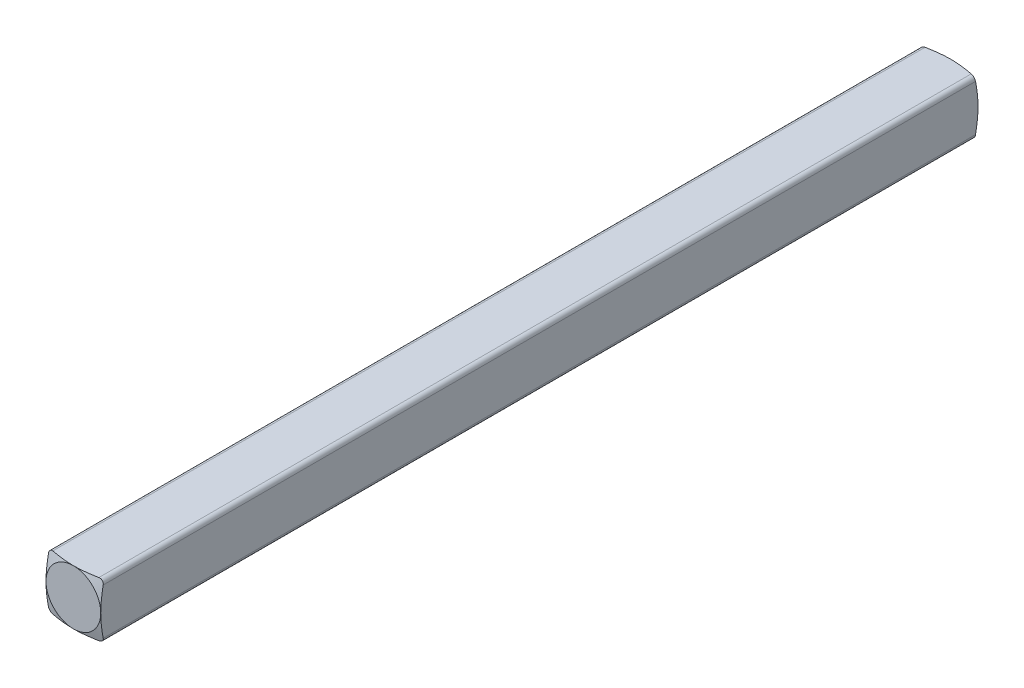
ISO-10303-21;
HEADER;
FILE_DESCRIPTION(('STEP AP214'),'2;1');
FILE_NAME('part.step','',(''),(''),'','','');
FILE_SCHEMA(('AUTOMOTIVE_DESIGN { 1 0 10303 214 1 1 1 1 }'));
ENDSEC;
DATA;
#1=APPLICATION_CONTEXT('core data for automotive mechanical design processes');
#2=APPLICATION_PROTOCOL_DEFINITION('international standard','automotive_design',2000,#1);
#3=PRODUCT_CONTEXT('',#1,'mechanical');
#4=PRODUCT('Part','Part','',(#3));
#5=PRODUCT_RELATED_PRODUCT_CATEGORY('part','',(#4));
#6=PRODUCT_DEFINITION_FORMATION('','',#4);
#7=PRODUCT_DEFINITION_CONTEXT('part definition',#1,'design');
#8=PRODUCT_DEFINITION('design','',#6,#7);
#9=PRODUCT_DEFINITION_SHAPE('','',#8);
#10=(LENGTH_UNIT() NAMED_UNIT(*) SI_UNIT(.MILLI.,.METRE.));
#11=(NAMED_UNIT(*) PLANE_ANGLE_UNIT() SI_UNIT($,.RADIAN.));
#12=(NAMED_UNIT(*) SI_UNIT($,.STERADIAN.) SOLID_ANGLE_UNIT());
#13=UNCERTAINTY_MEASURE_WITH_UNIT(LENGTH_MEASURE(1.E-05),#10,'distance_accuracy_value','');
#14=(GEOMETRIC_REPRESENTATION_CONTEXT(3) GLOBAL_UNCERTAINTY_ASSIGNED_CONTEXT((#13)) GLOBAL_UNIT_ASSIGNED_CONTEXT((#10,
#11,#12)) REPRESENTATION_CONTEXT('',''));
#15=CARTESIAN_POINT('',(0.,0.,0.));
#16=DIRECTION('',(0.,0.,1.));
#17=DIRECTION('',(1.,0.,0.));
#18=AXIS2_PLACEMENT_3D('',#15,#16,#17);
#19=CARTESIAN_POINT('',(-1.53487723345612,-1.585,25.4));
#20=DIRECTION('',(1.,0.,0.));
#21=DIRECTION('',(0.,1.,0.));
#22=AXIS2_PLACEMENT_3D('',#19,#20,#21);
#23=PLANE('',#22);
#24=CARTESIAN_POINT('',(-1.53487723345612,-3.1666652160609,-24.8259021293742));
#25=CARTESIAN_POINT('',(-1.53487723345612,-3.08469064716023,-24.8474134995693));
#26=CARTESIAN_POINT('',(-1.53487723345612,-3.0026760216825,-24.8687725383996));
#27=CARTESIAN_POINT('',(-1.53487723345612,-2.83854664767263,-24.9111088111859));
#28=CARTESIAN_POINT('',(-1.53487723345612,-2.75643189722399,-24.9320860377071));
#29=CARTESIAN_POINT('',(-1.53487723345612,-2.50995900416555,-24.9943162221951));
#30=CARTESIAN_POINT('',(-1.53487723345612,-2.34542557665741,-25.03488001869));
#31=CARTESIAN_POINT('',(-1.53487723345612,-2.01672815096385,-25.1129127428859));
#32=CARTESIAN_POINT('',(-1.53487723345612,-1.85256851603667,-25.150399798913));
#33=CARTESIAN_POINT('',(-1.53487723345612,-1.52315459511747,-25.2208840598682));
#34=CARTESIAN_POINT('',(-1.53487723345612,-1.3578996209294,-25.2538780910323));
#35=CARTESIAN_POINT('',(-1.53487723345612,-1.02346692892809,-25.3128592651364));
#36=CARTESIAN_POINT('',(-1.53487723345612,-0.854267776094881,-25.3387322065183));
#37=CARTESIAN_POINT('',(-1.53487723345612,-0.599515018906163,-25.368359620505));
#38=CARTESIAN_POINT('',(-1.53487723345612,-0.514501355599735,-25.3767023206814));
#39=CARTESIAN_POINT('',(-1.53487723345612,-0.34419324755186,-25.3897696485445));
#40=CARTESIAN_POINT('',(-1.53487723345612,-0.258898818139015,-25.3944944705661));
#41=CARTESIAN_POINT('',(-1.53487723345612,-0.0877661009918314,-25.3999590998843));
#42=CARTESIAN_POINT('',(-1.53487723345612,-0.0019271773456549,-25.4006795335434));
#43=CARTESIAN_POINT('',(-1.53487723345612,0.169686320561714,-25.39801863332));
#44=CARTESIAN_POINT('',(-1.53487723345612,0.25546089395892,-25.3946372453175));
#45=CARTESIAN_POINT('',(-1.53487723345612,0.426896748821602,-25.3840536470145));
#46=CARTESIAN_POINT('',(-1.53487723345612,0.51255766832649,-25.3768457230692));
#47=CARTESIAN_POINT('',(-1.53487723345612,0.683531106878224,-25.3591333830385));
#48=CARTESIAN_POINT('',(-1.53487723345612,0.768843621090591,-25.3486289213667));
#49=CARTESIAN_POINT('',(-1.53487723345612,0.97405504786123,-25.3200668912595));
#50=CARTESIAN_POINT('',(-1.53487723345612,1.09376665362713,-25.3006791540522));
#51=CARTESIAN_POINT('',(-1.53487723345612,1.33251777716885,-25.2580930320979));
#52=CARTESIAN_POINT('',(-1.53487723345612,1.45155714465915,-25.2348938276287));
#53=CARTESIAN_POINT('',(-1.53487723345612,1.68916216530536,-25.1858147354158));
#54=CARTESIAN_POINT('',(-1.53487723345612,1.80772743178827,-25.159932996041));
#55=CARTESIAN_POINT('',(-1.53487723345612,2.04441891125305,-25.1062944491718));
#56=CARTESIAN_POINT('',(-1.53487723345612,2.1625451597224,-25.0785377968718));
#57=CARTESIAN_POINT('',(-1.53487723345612,2.39875520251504,-25.021613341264));
#58=CARTESIAN_POINT('',(-1.53487723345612,2.5168382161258,-24.9924423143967));
#59=CARTESIAN_POINT('',(-1.53487723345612,2.75275603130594,-24.9331112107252));
#60=CARTESIAN_POINT('',(-1.53487723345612,2.8705908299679,-24.9029511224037));
#61=CARTESIAN_POINT('',(-1.53487723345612,3.22371274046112,-24.8114063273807));
#62=CARTESIAN_POINT('',(-1.53487723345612,3.45871696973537,-24.7489325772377));
#63=CARTESIAN_POINT('',(-1.53487723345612,3.92636425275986,-24.6228008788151));
#64=CARTESIAN_POINT('',(-1.53487723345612,4.15901102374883,-24.5591566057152));
#65=CARTESIAN_POINT('',(-1.53487723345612,4.62403801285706,-24.4307856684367));
#66=CARTESIAN_POINT('',(-1.53487723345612,4.85641819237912,-24.3660588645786));
#67=CARTESIAN_POINT('',(-1.53487723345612,5.31976447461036,-24.2362295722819));
#68=CARTESIAN_POINT('',(-1.53487723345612,5.55073162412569,-24.1711308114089));
#69=CARTESIAN_POINT('',(-1.53487723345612,6.01248807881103,-24.0404294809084));
#70=CARTESIAN_POINT('',(-1.53487723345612,6.24327740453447,-23.9748269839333));
#71=CARTESIAN_POINT('',(-1.53487723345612,6.47402102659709,-23.9090655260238));
#72=B_SPLINE_CURVE_WITH_KNOTS('',3,(#24,#25,#26,#27,#28,#29,#30,#31,#32,#33,#34,#35,#36,#37,#38,
#39,#40,#41,#42,#43,#44,#45,#46,#47,#48,#49,#50,#51,#52,#53,#54,#55,#56,#57,#58,#59,#60,#61,#62,
#63,#64,#65,#66,#67,#68,#69,#70,#71),.UNSPECIFIED.,.F.,.F.,(4,2,2,2,2,2,2,2,2,2,2,2,2,2,2,2,2,2,
2,2,2,2,2,4),(0.,0.254249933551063,0.508504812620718,1.01686983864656,1.5219847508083,
2.02745463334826,2.54061232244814,2.79681427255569,3.05300245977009,3.31042903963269,
3.56785901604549,3.82567446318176,4.08349347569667,4.44721252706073,4.81100990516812,
5.17506008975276,5.539080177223,5.90397296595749,6.2688700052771,6.99835638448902,
7.72193914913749,8.44561600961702,9.16551335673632,9.88530875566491),.UNSPECIFIED.);
#73=CARTESIAN_POINT('',(-1.53487723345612,0.,-25.4));
#74=VERTEX_POINT('',#73);
#75=CARTESIAN_POINT('',(-1.53487723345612,-1.335,-25.25698643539));
#76=VERTEX_POINT('',#75);
#77=EDGE_CURVE('E126',#74,#76,#72,.F.);
#78=ORIENTED_EDGE('',*,*,#77,.T.);
#79=DIRECTION('',(0.,0.,-1.));
#80=VECTOR('',#79,1.);
#81=CARTESIAN_POINT('',(-1.53487723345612,-1.335,25.4));
#82=LINE('',#81,#80);
#83=CARTESIAN_POINT('',(-1.53487723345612,-1.335,25.25698643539));
#84=VERTEX_POINT('',#83);
#85=EDGE_CURVE('E56',#76,#84,#82,.F.);
#86=ORIENTED_EDGE('',*,*,#85,.T.);
#87=CARTESIAN_POINT('',(-1.53487723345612,-3.1666652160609,24.8259021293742));
#88=CARTESIAN_POINT('',(-1.53487723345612,-3.08469064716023,24.8474134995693));
#89=CARTESIAN_POINT('',(-1.53487723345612,-3.0026760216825,24.8687725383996));
#90=CARTESIAN_POINT('',(-1.53487723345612,-2.83854664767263,24.9111088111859));
#91=CARTESIAN_POINT('',(-1.53487723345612,-2.75643189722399,24.9320860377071));
#92=CARTESIAN_POINT('',(-1.53487723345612,-2.50995900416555,24.9943162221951));
#93=CARTESIAN_POINT('',(-1.53487723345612,-2.34542557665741,25.03488001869));
#94=CARTESIAN_POINT('',(-1.53487723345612,-2.01672815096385,25.1129127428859));
#95=CARTESIAN_POINT('',(-1.53487723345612,-1.85256851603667,25.150399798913));
#96=CARTESIAN_POINT('',(-1.53487723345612,-1.52315459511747,25.2208840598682));
#97=CARTESIAN_POINT('',(-1.53487723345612,-1.3578996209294,25.2538780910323));
#98=CARTESIAN_POINT('',(-1.53487723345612,-1.02346692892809,25.3128592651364));
#99=CARTESIAN_POINT('',(-1.53487723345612,-0.854267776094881,25.3387322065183));
#100=CARTESIAN_POINT('',(-1.53487723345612,-0.599515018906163,25.368359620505));
#101=CARTESIAN_POINT('',(-1.53487723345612,-0.514501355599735,25.3767023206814));
#102=CARTESIAN_POINT('',(-1.53487723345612,-0.34419324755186,25.3897696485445));
#103=CARTESIAN_POINT('',(-1.53487723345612,-0.258898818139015,25.3944944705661));
#104=CARTESIAN_POINT('',(-1.53487723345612,-0.0877661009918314,25.3999590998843));
#105=CARTESIAN_POINT('',(-1.53487723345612,-0.0019271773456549,25.4006795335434));
#106=CARTESIAN_POINT('',(-1.53487723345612,0.169686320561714,25.39801863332));
#107=CARTESIAN_POINT('',(-1.53487723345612,0.25546089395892,25.3946372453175));
#108=CARTESIAN_POINT('',(-1.53487723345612,0.426896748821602,25.3840536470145));
#109=CARTESIAN_POINT('',(-1.53487723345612,0.51255766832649,25.3768457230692));
#110=CARTESIAN_POINT('',(-1.53487723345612,0.683531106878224,25.3591333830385));
#111=CARTESIAN_POINT('',(-1.53487723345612,0.768843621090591,25.3486289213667));
#112=CARTESIAN_POINT('',(-1.53487723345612,0.97405504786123,25.3200668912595));
#113=CARTESIAN_POINT('',(-1.53487723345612,1.09376665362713,25.3006791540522));
#114=CARTESIAN_POINT('',(-1.53487723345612,1.33251777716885,25.2580930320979));
#115=CARTESIAN_POINT('',(-1.53487723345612,1.45155714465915,25.2348938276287));
#116=CARTESIAN_POINT('',(-1.53487723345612,1.68916216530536,25.1858147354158));
#117=CARTESIAN_POINT('',(-1.53487723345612,1.80772743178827,25.159932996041));
#118=CARTESIAN_POINT('',(-1.53487723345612,2.04441891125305,25.1062944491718));
#119=CARTESIAN_POINT('',(-1.53487723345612,2.1625451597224,25.0785377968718));
#120=CARTESIAN_POINT('',(-1.53487723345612,2.39875520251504,25.021613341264));
#121=CARTESIAN_POINT('',(-1.53487723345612,2.5168382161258,24.9924423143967));
#122=CARTESIAN_POINT('',(-1.53487723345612,2.75275603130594,24.9331112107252));
#123=CARTESIAN_POINT('',(-1.53487723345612,2.8705908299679,24.9029511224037));
#124=CARTESIAN_POINT('',(-1.53487723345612,3.22371274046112,24.8114063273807));
#125=CARTESIAN_POINT('',(-1.53487723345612,3.45871696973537,24.7489325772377));
#126=CARTESIAN_POINT('',(-1.53487723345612,3.92636425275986,24.6228008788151));
#127=CARTESIAN_POINT('',(-1.53487723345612,4.15901102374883,24.5591566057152));
#128=CARTESIAN_POINT('',(-1.53487723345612,4.62403801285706,24.4307856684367));
#129=CARTESIAN_POINT('',(-1.53487723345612,4.85641819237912,24.3660588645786));
#130=CARTESIAN_POINT('',(-1.53487723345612,5.31976447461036,24.2362295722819));
#131=CARTESIAN_POINT('',(-1.53487723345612,5.55073162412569,24.1711308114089));
#132=CARTESIAN_POINT('',(-1.53487723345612,6.01248807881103,24.0404294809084));
#133=CARTESIAN_POINT('',(-1.53487723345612,6.24327740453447,23.9748269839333));
#134=CARTESIAN_POINT('',(-1.53487723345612,6.47402102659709,23.9090655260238));
#135=B_SPLINE_CURVE_WITH_KNOTS('',3,(#87,#88,#89,#90,#91,#92,#93,#94,#95,#96,#97,#98,#99,#100,
#101,#102,#103,#104,#105,#106,#107,#108,#109,#110,#111,#112,#113,#114,#115,#116,#117,#118,#119,
#120,#121,#122,#123,#124,#125,#126,#127,#128,#129,#130,#131,#132,#133,#134),.UNSPECIFIED.,.F.,
.F.,(4,2,2,2,2,2,2,2,2,2,2,2,2,2,2,2,2,2,2,2,2,2,2,4),(0.,0.254249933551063,0.508504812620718,
1.01686983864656,1.5219847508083,2.02745463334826,2.54061232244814,2.79681427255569,
3.05300245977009,3.31042903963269,3.56785901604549,3.82567446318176,4.08349347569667,
4.44721252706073,4.81100990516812,5.17506008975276,5.539080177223,5.90397296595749,
6.2688700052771,6.99835638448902,7.72193914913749,8.44561600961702,9.16551335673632,
9.88530875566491),.UNSPECIFIED.);
#136=CARTESIAN_POINT('',(-1.53487723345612,0.,25.4));
#137=VERTEX_POINT('',#136);
#138=EDGE_CURVE('E453',#84,#137,#135,.T.);
#139=ORIENTED_EDGE('',*,*,#138,.T.);
#140=CARTESIAN_POINT('',(-1.53487723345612,1.33500000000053,25.2569864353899));
#141=VERTEX_POINT('',#140);
#142=EDGE_CURVE('E187',#137,#141,#135,.T.);
#143=ORIENTED_EDGE('',*,*,#142,.T.);
#144=DIRECTION('',(0.,0.,-1.));
#145=VECTOR('',#144,1.);
#146=CARTESIAN_POINT('',(-1.53487723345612,1.335,25.4));
#147=LINE('',#146,#145);
#148=CARTESIAN_POINT('',(-1.53487723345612,1.33500000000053,-25.2569864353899));
#149=VERTEX_POINT('',#148);
#150=EDGE_CURVE('E128',#141,#149,#147,.T.);
#151=ORIENTED_EDGE('',*,*,#150,.T.);
#152=EDGE_CURVE('E124',#149,#74,#72,.F.);
#153=ORIENTED_EDGE('',*,*,#152,.T.);
#154=EDGE_LOOP('',(#78,#86,#139,#143,#151,#153));
#155=FACE_BOUND('',#154,.T.);
#156=ADVANCED_FACE('F30',(#155),#23,.F.);
#157=CARTESIAN_POINT('',(-1.53487723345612,-1.585,25.4));
#158=DIRECTION('',(0.,1.,0.));
#159=DIRECTION('',(-1.,0.,0.));
#160=AXIS2_PLACEMENT_3D('',#157,#158,#159);
#161=PLANE('',#160);
#162=CARTESIAN_POINT('',(-3.11654636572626,-1.585,-24.8259011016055));
#163=CARTESIAN_POINT('',(-3.03457163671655,-1.585,-24.8474125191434));
#164=CARTESIAN_POINT('',(-2.95255685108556,-1.585,-24.8687716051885));
#165=CARTESIAN_POINT('',(-2.78842715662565,-1.585,-24.9111079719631));
#166=CARTESIAN_POINT('',(-2.70631224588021,-1.585,-24.932085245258));
#167=CARTESIAN_POINT('',(-2.45983887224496,-1.585,-24.9943155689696));
#168=CARTESIAN_POINT('',(-2.29530512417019,-1.585,-25.0348794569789));
#169=CARTESIAN_POINT('',(-1.96660706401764,-1.585,-25.1129123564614));
#170=CARTESIAN_POINT('',(-1.80244711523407,-1.585,-25.1503994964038));
#171=CARTESIAN_POINT('',(-1.4730325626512,-1.585,-25.2208839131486));
#172=CARTESIAN_POINT('',(-1.30777727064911,-1.585,-25.2538780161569));
#173=CARTESIAN_POINT('',(-0.973343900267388,-1.585,-25.3128593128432));
#174=CARTESIAN_POINT('',(-0.804144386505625,-1.585,-25.3387323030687));
#175=CARTESIAN_POINT('',(-0.549391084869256,-1.585,-25.3683597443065));
#176=CARTESIAN_POINT('',(-0.464377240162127,-1.585,-25.3767024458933));
#177=CARTESIAN_POINT('',(-0.294068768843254,-1.585,-25.3897697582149));
#178=CARTESIAN_POINT('',(-0.208774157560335,-1.585,-25.3944945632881));
#179=CARTESIAN_POINT('',(-0.0376410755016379,-1.585,-25.3999591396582));
#180=CARTESIAN_POINT('',(0.0481980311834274,-1.585,-25.400679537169));
#181=CARTESIAN_POINT('',(0.219811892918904,-1.585,-25.3980185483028));
#182=CARTESIAN_POINT('',(0.305586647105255,-1.585,-25.3946371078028));
#183=CARTESIAN_POINT('',(0.477022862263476,-1.585,-25.384053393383));
#184=CARTESIAN_POINT('',(0.562683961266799,-1.585,-25.3768454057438));
#185=CARTESIAN_POINT('',(0.733657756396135,-1.585,-25.35913293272));
#186=CARTESIAN_POINT('',(0.818970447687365,-1.585,-25.3486284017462));
#187=CARTESIAN_POINT('',(1.02418204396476,-1.585,-25.3200662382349));
#188=CARTESIAN_POINT('',(1.14389364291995,-1.585,-25.3006784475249));
#189=CARTESIAN_POINT('',(1.38264475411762,-1.585,-25.2580922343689));
#190=CARTESIAN_POINT('',(1.50168411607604,-1.585,-25.2348929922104));
#191=CARTESIAN_POINT('',(1.73928912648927,-1.585,-25.1858138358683));
#192=CARTESIAN_POINT('',(1.85785438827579,-1.585,-25.1599320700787));
#193=CARTESIAN_POINT('',(2.09454585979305,-1.585,-25.1062934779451));
#194=CARTESIAN_POINT('',(2.21267210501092,-1.585,-25.0785368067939));
#195=CARTESIAN_POINT('',(2.44888213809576,-1.585,-25.0216123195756));
#196=CARTESIAN_POINT('',(2.56696514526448,-1.585,-24.9924412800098));
#197=CARTESIAN_POINT('',(2.80288294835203,-1.585,-24.9331101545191));
#198=CARTESIAN_POINT('',(2.92071774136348,-1.585,-24.902950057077));
#199=CARTESIAN_POINT('',(3.27383963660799,-1.585,-24.8114052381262));
#200=CARTESIAN_POINT('',(3.50884385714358,-1.585,-24.7489314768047));
#201=CARTESIAN_POINT('',(3.97649110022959,-1.585,-24.6227997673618));
#202=CARTESIAN_POINT('',(4.20913784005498,-1.585,-24.5591554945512));
#203=CARTESIAN_POINT('',(4.67416476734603,-1.585,-24.4307845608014));
#204=CARTESIAN_POINT('',(4.90654491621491,-1.585,-24.3660577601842));
#205=CARTESIAN_POINT('',(5.36989115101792,-1.585,-24.2362284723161));
#206=CARTESIAN_POINT('',(5.60085828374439,-1.585,-24.1711297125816));
#207=CARTESIAN_POINT('',(6.06261470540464,-1.585,-24.0404283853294));
#208=CARTESIAN_POINT('',(6.29340401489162,-1.585,-23.9748258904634));
#209=CARTESIAN_POINT('',(6.52414762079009,-1.585,-23.9090644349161));
#210=B_SPLINE_CURVE_WITH_KNOTS('',3,(#162,#163,#164,#165,#166,#167,#168,#169,#170,#171,#172,
#173,#174,#175,#176,#177,#178,#179,#180,#181,#182,#183,#184,#185,#186,#187,#188,#189,#190,#191,
#192,#193,#194,#195,#196,#197,#198,#199,#200,#201,#202,#203,#204,#205,#206,#207,#208,#209),
.UNSPECIFIED.,.F.,.F.,(4,2,2,2,2,2,2,2,2,2,2,2,2,2,2,2,2,2,2,2,2,2,2,4),(0.,0.254250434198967,
0.508505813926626,1.01687183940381,1.52198772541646,2.02745858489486,2.54061736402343,
2.79681985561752,3.05300858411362,3.31043571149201,3.56786623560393,3.82568223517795,
4.08350180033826,4.44722085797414,4.81101824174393,5.17506842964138,5.53908852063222,
5.90398129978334,6.26887832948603,6.9983646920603,7.72194736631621,8.44562413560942,
9.16552143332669,9.88531678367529),.UNSPECIFIED.);
#211=CARTESIAN_POINT('',(0.0501227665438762,-1.585,-25.4));
#212=VERTEX_POINT('',#211);
#213=CARTESIAN_POINT('',(1.38512276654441,-1.585,-25.2569864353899));
#214=VERTEX_POINT('',#213);
#215=EDGE_CURVE('E208',#212,#214,#210,.T.);
#216=ORIENTED_EDGE('',*,*,#215,.T.);
#217=DIRECTION('',(0.,0.,-1.));
#218=VECTOR('',#217,1.);
#219=CARTESIAN_POINT('',(1.38512276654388,-1.585,25.4));
#220=LINE('',#219,#218);
#221=CARTESIAN_POINT('',(1.38512276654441,-1.585,25.2569864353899));
#222=VERTEX_POINT('',#221);
#223=EDGE_CURVE('E426',#214,#222,#220,.F.);
#224=ORIENTED_EDGE('',*,*,#223,.T.);
#225=CARTESIAN_POINT('',(-3.11654636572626,-1.585,24.8259011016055));
#226=CARTESIAN_POINT('',(-3.03457163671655,-1.585,24.8474125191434));
#227=CARTESIAN_POINT('',(-2.95255685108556,-1.585,24.8687716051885));
#228=CARTESIAN_POINT('',(-2.78842715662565,-1.585,24.9111079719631));
#229=CARTESIAN_POINT('',(-2.70631224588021,-1.585,24.932085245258));
#230=CARTESIAN_POINT('',(-2.45983887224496,-1.585,24.9943155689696));
#231=CARTESIAN_POINT('',(-2.29530512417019,-1.585,25.0348794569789));
#232=CARTESIAN_POINT('',(-1.96660706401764,-1.585,25.1129123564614));
#233=CARTESIAN_POINT('',(-1.80244711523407,-1.585,25.1503994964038));
#234=CARTESIAN_POINT('',(-1.4730325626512,-1.585,25.2208839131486));
#235=CARTESIAN_POINT('',(-1.30777727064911,-1.585,25.2538780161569));
#236=CARTESIAN_POINT('',(-0.973343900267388,-1.585,25.3128593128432));
#237=CARTESIAN_POINT('',(-0.804144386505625,-1.585,25.3387323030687));
#238=CARTESIAN_POINT('',(-0.549391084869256,-1.585,25.3683597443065));
#239=CARTESIAN_POINT('',(-0.464377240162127,-1.585,25.3767024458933));
#240=CARTESIAN_POINT('',(-0.294068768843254,-1.585,25.3897697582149));
#241=CARTESIAN_POINT('',(-0.208774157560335,-1.585,25.3944945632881));
#242=CARTESIAN_POINT('',(-0.0376410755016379,-1.585,25.3999591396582));
#243=CARTESIAN_POINT('',(0.0481980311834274,-1.585,25.400679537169));
#244=CARTESIAN_POINT('',(0.219811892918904,-1.585,25.3980185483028));
#245=CARTESIAN_POINT('',(0.305586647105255,-1.585,25.3946371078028));
#246=CARTESIAN_POINT('',(0.477022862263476,-1.585,25.384053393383));
#247=CARTESIAN_POINT('',(0.562683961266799,-1.585,25.3768454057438));
#248=CARTESIAN_POINT('',(0.733657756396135,-1.585,25.35913293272));
#249=CARTESIAN_POINT('',(0.818970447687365,-1.585,25.3486284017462));
#250=CARTESIAN_POINT('',(1.02418204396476,-1.585,25.3200662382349));
#251=CARTESIAN_POINT('',(1.14389364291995,-1.585,25.3006784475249));
#252=CARTESIAN_POINT('',(1.38264475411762,-1.585,25.2580922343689));
#253=CARTESIAN_POINT('',(1.50168411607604,-1.585,25.2348929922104));
#254=CARTESIAN_POINT('',(1.73928912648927,-1.585,25.1858138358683));
#255=CARTESIAN_POINT('',(1.85785438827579,-1.585,25.1599320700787));
#256=CARTESIAN_POINT('',(2.09454585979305,-1.585,25.1062934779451));
#257=CARTESIAN_POINT('',(2.21267210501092,-1.585,25.0785368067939));
#258=CARTESIAN_POINT('',(2.44888213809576,-1.585,25.0216123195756));
#259=CARTESIAN_POINT('',(2.56696514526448,-1.585,24.9924412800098));
#260=CARTESIAN_POINT('',(2.80288294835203,-1.585,24.9331101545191));
#261=CARTESIAN_POINT('',(2.92071774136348,-1.585,24.902950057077));
#262=CARTESIAN_POINT('',(3.27383963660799,-1.585,24.8114052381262));
#263=CARTESIAN_POINT('',(3.50884385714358,-1.585,24.7489314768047));
#264=CARTESIAN_POINT('',(3.97649110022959,-1.585,24.6227997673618));
#265=CARTESIAN_POINT('',(4.20913784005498,-1.585,24.5591554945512));
#266=CARTESIAN_POINT('',(4.67416476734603,-1.585,24.4307845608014));
#267=CARTESIAN_POINT('',(4.90654491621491,-1.585,24.3660577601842));
#268=CARTESIAN_POINT('',(5.36989115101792,-1.585,24.2362284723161));
#269=CARTESIAN_POINT('',(5.60085828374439,-1.585,24.1711297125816));
#270=CARTESIAN_POINT('',(6.06261470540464,-1.585,24.0404283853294));
#271=CARTESIAN_POINT('',(6.29340401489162,-1.585,23.9748258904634));
#272=CARTESIAN_POINT('',(6.52414762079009,-1.585,23.9090644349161));
#273=B_SPLINE_CURVE_WITH_KNOTS('',3,(#225,#226,#227,#228,#229,#230,#231,#232,#233,#234,#235,
#236,#237,#238,#239,#240,#241,#242,#243,#244,#245,#246,#247,#248,#249,#250,#251,#252,#253,#254,
#255,#256,#257,#258,#259,#260,#261,#262,#263,#264,#265,#266,#267,#268,#269,#270,#271,#272),
.UNSPECIFIED.,.F.,.F.,(4,2,2,2,2,2,2,2,2,2,2,2,2,2,2,2,2,2,2,2,2,2,2,4),(0.,0.254250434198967,
0.508505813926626,1.01687183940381,1.52198772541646,2.02745858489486,2.54061736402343,
2.79681985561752,3.05300858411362,3.31043571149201,3.56786623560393,3.82568223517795,
4.08350180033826,4.44722085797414,4.81101824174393,5.17506842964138,5.53908852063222,
5.90398129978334,6.26887832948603,6.9983646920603,7.72194736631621,8.44562413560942,
9.16552143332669,9.88531678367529),.UNSPECIFIED.);
#274=CARTESIAN_POINT('',(0.0501227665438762,-1.585,25.4));
#275=VERTEX_POINT('',#274);
#276=EDGE_CURVE('E174',#222,#275,#273,.F.);
#277=ORIENTED_EDGE('',*,*,#276,.T.);
#278=CARTESIAN_POINT('',(-1.28487723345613,-1.585,25.25698643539));
#279=VERTEX_POINT('',#278);
#280=EDGE_CURVE('E176',#275,#279,#273,.F.);
#281=ORIENTED_EDGE('',*,*,#280,.T.);
#282=DIRECTION('',(0.,0.,-1.));
#283=VECTOR('',#282,1.);
#284=CARTESIAN_POINT('',(-1.28487723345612,-1.585,25.4));
#285=LINE('',#284,#283);
#286=CARTESIAN_POINT('',(-1.28487723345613,-1.585,-25.25698643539));
#287=VERTEX_POINT('',#286);
#288=EDGE_CURVE('E431',#279,#287,#285,.T.);
#289=ORIENTED_EDGE('',*,*,#288,.T.);
#290=EDGE_CURVE('E141',#287,#212,#210,.T.);
#291=ORIENTED_EDGE('',*,*,#290,.T.);
#292=EDGE_LOOP('',(#216,#224,#277,#281,#289,#291));
#293=FACE_BOUND('',#292,.T.);
#294=ADVANCED_FACE('F197',(#293),#161,.F.);
#295=CARTESIAN_POINT('',(1.63512276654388,-1.585,25.4));
#296=DIRECTION('',(-1.,0.,0.));
#297=DIRECTION('',(0.,-1.,0.));
#298=AXIS2_PLACEMENT_3D('',#295,#296,#297);
#299=PLANE('',#298);
#300=CARTESIAN_POINT('',(1.63512276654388,-3.16666913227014,-24.8259011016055));
#301=CARTESIAN_POINT('',(1.63512276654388,-3.08469440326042,-24.8474125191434));
#302=CARTESIAN_POINT('',(1.63512276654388,-3.00267961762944,-24.8687716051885));
#303=CARTESIAN_POINT('',(1.63512276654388,-2.83854992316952,-24.9111079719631));
#304=CARTESIAN_POINT('',(1.63512276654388,-2.75643501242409,-24.932085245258));
#305=CARTESIAN_POINT('',(1.63512276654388,-2.50996163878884,-24.9943155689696));
#306=CARTESIAN_POINT('',(1.63512276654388,-2.34542789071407,-25.0348794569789));
#307=CARTESIAN_POINT('',(1.63512276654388,-2.01672983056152,-25.1129123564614));
#308=CARTESIAN_POINT('',(1.63512276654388,-1.85256988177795,-25.1503994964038));
#309=CARTESIAN_POINT('',(1.63512276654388,-1.52315532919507,-25.2208839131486));
#310=CARTESIAN_POINT('',(1.63512276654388,-1.35790003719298,-25.2538780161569));
#311=CARTESIAN_POINT('',(1.63512276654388,-1.02346666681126,-25.3128593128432));
#312=CARTESIAN_POINT('',(1.63512276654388,-0.854267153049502,-25.3387323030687));
#313=CARTESIAN_POINT('',(1.63512276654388,-0.599513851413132,-25.3683597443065));
#314=CARTESIAN_POINT('',(1.63512276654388,-0.514500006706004,-25.3767024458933));
#315=CARTESIAN_POINT('',(1.63512276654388,-0.34419153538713,-25.3897697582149));
#316=CARTESIAN_POINT('',(1.63512276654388,-0.258896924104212,-25.3944945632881));
#317=CARTESIAN_POINT('',(1.63512276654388,-0.0877638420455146,-25.3999591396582));
#318=CARTESIAN_POINT('',(1.63512276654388,-0.00192473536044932,-25.400679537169));
#319=CARTESIAN_POINT('',(1.63512276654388,0.169689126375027,-25.3980185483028));
#320=CARTESIAN_POINT('',(1.63512276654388,0.255463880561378,-25.3946371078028));
#321=CARTESIAN_POINT('',(1.63512276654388,0.4269000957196,-25.384053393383));
#322=CARTESIAN_POINT('',(1.63512276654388,0.512561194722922,-25.3768454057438));
#323=CARTESIAN_POINT('',(1.63512276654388,0.683534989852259,-25.35913293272));
#324=CARTESIAN_POINT('',(1.63512276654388,0.768847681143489,-25.3486284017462));
#325=CARTESIAN_POINT('',(1.63512276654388,0.974059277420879,-25.3200662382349));
#326=CARTESIAN_POINT('',(1.63512276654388,1.09377087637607,-25.3006784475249));
#327=CARTESIAN_POINT('',(1.63512276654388,1.33252198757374,-25.2580922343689));
#328=CARTESIAN_POINT('',(1.63512276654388,1.45156134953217,-25.2348929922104));
#329=CARTESIAN_POINT('',(1.63512276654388,1.6891663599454,-25.1858138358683));
#330=CARTESIAN_POINT('',(1.63512276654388,1.80773162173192,-25.1599320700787));
#331=CARTESIAN_POINT('',(1.63512276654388,2.04442309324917,-25.1062934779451));
#332=CARTESIAN_POINT('',(1.63512276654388,2.16254933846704,-25.0785368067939));
#333=CARTESIAN_POINT('',(1.63512276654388,2.39875937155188,-25.0216123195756));
#334=CARTESIAN_POINT('',(1.63512276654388,2.5168423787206,-24.9924412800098));
#335=CARTESIAN_POINT('',(1.63512276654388,2.75276018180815,-24.9331101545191));
#336=CARTESIAN_POINT('',(1.63512276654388,2.87059497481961,-24.902950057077));
#337=CARTESIAN_POINT('',(1.63512276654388,3.22371687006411,-24.8114052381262));
#338=CARTESIAN_POINT('',(1.63512276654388,3.4587210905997,-24.7489314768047));
#339=CARTESIAN_POINT('',(1.63512276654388,3.92636833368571,-24.6227997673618));
#340=CARTESIAN_POINT('',(1.63512276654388,4.1590150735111,-24.5591554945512));
#341=CARTESIAN_POINT('',(1.63512276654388,4.62404200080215,-24.4307845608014));
#342=CARTESIAN_POINT('',(1.63512276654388,4.85642214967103,-24.3660577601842));
#343=CARTESIAN_POINT('',(1.63512276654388,5.31976838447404,-24.2362284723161));
#344=CARTESIAN_POINT('',(1.63512276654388,5.55073551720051,-24.1711297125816));
#345=CARTESIAN_POINT('',(1.63512276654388,6.01249193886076,-24.0404283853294));
#346=CARTESIAN_POINT('',(1.63512276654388,6.24328124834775,-23.9748258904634));
#347=CARTESIAN_POINT('',(1.63512276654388,6.47402485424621,-23.9090644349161));
#348=B_SPLINE_CURVE_WITH_KNOTS('',3,(#300,#301,#302,#303,#304,#305,#306,#307,#308,#309,#310,
#311,#312,#313,#314,#315,#316,#317,#318,#319,#320,#321,#322,#323,#324,#325,#326,#327,#328,#329,
#330,#331,#332,#333,#334,#335,#336,#337,#338,#339,#340,#341,#342,#343,#344,#345,#346,#347),
.UNSPECIFIED.,.F.,.F.,(4,2,2,2,2,2,2,2,2,2,2,2,2,2,2,2,2,2,2,2,2,2,2,4),(0.,0.254250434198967,
0.508505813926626,1.01687183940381,1.52198772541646,2.02745858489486,2.54061736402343,
2.79681985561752,3.05300858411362,3.31043571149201,3.56786623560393,3.82568223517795,
4.08350180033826,4.44722085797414,4.81101824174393,5.17506842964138,5.53908852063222,
5.90398129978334,6.26887832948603,6.9983646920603,7.72194736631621,8.44562413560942,
9.16552143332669,9.88531678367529),.UNSPECIFIED.);
#349=CARTESIAN_POINT('',(1.63512276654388,0.,-25.4));
#350=VERTEX_POINT('',#349);
#351=CARTESIAN_POINT('',(1.63512276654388,1.33500000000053,-25.2569864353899));
#352=VERTEX_POINT('',#351);
#353=EDGE_CURVE('E215',#350,#352,#348,.T.);
#354=ORIENTED_EDGE('',*,*,#353,.T.);
#355=DIRECTION('',(0.,0.,-1.));
#356=VECTOR('',#355,1.);
#357=CARTESIAN_POINT('',(1.63512276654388,1.335,25.4));
#358=LINE('',#357,#356);
#359=CARTESIAN_POINT('',(1.63512276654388,1.33500000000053,25.2569864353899));
#360=VERTEX_POINT('',#359);
#361=EDGE_CURVE('E437',#352,#360,#358,.F.);
#362=ORIENTED_EDGE('',*,*,#361,.T.);
#363=CARTESIAN_POINT('',(1.63512276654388,-3.16666913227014,24.8259011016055));
#364=CARTESIAN_POINT('',(1.63512276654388,-3.08469440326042,24.8474125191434));
#365=CARTESIAN_POINT('',(1.63512276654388,-3.00267961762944,24.8687716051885));
#366=CARTESIAN_POINT('',(1.63512276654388,-2.83854992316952,24.9111079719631));
#367=CARTESIAN_POINT('',(1.63512276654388,-2.75643501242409,24.932085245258));
#368=CARTESIAN_POINT('',(1.63512276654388,-2.50996163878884,24.9943155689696));
#369=CARTESIAN_POINT('',(1.63512276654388,-2.34542789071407,25.0348794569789));
#370=CARTESIAN_POINT('',(1.63512276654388,-2.01672983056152,25.1129123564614));
#371=CARTESIAN_POINT('',(1.63512276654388,-1.85256988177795,25.1503994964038));
#372=CARTESIAN_POINT('',(1.63512276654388,-1.52315532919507,25.2208839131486));
#373=CARTESIAN_POINT('',(1.63512276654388,-1.35790003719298,25.2538780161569));
#374=CARTESIAN_POINT('',(1.63512276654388,-1.02346666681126,25.3128593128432));
#375=CARTESIAN_POINT('',(1.63512276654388,-0.854267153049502,25.3387323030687));
#376=CARTESIAN_POINT('',(1.63512276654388,-0.599513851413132,25.3683597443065));
#377=CARTESIAN_POINT('',(1.63512276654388,-0.514500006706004,25.3767024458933));
#378=CARTESIAN_POINT('',(1.63512276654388,-0.34419153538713,25.3897697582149));
#379=CARTESIAN_POINT('',(1.63512276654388,-0.258896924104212,25.3944945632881));
#380=CARTESIAN_POINT('',(1.63512276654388,-0.0877638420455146,25.3999591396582));
#381=CARTESIAN_POINT('',(1.63512276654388,-0.00192473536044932,25.400679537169));
#382=CARTESIAN_POINT('',(1.63512276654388,0.169689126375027,25.3980185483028));
#383=CARTESIAN_POINT('',(1.63512276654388,0.255463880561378,25.3946371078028));
#384=CARTESIAN_POINT('',(1.63512276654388,0.4269000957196,25.384053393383));
#385=CARTESIAN_POINT('',(1.63512276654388,0.512561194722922,25.3768454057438));
#386=CARTESIAN_POINT('',(1.63512276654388,0.683534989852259,25.35913293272));
#387=CARTESIAN_POINT('',(1.63512276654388,0.768847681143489,25.3486284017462));
#388=CARTESIAN_POINT('',(1.63512276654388,0.974059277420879,25.3200662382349));
#389=CARTESIAN_POINT('',(1.63512276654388,1.09377087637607,25.3006784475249));
#390=CARTESIAN_POINT('',(1.63512276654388,1.33252198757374,25.2580922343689));
#391=CARTESIAN_POINT('',(1.63512276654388,1.45156134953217,25.2348929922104));
#392=CARTESIAN_POINT('',(1.63512276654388,1.6891663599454,25.1858138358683));
#393=CARTESIAN_POINT('',(1.63512276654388,1.80773162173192,25.1599320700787));
#394=CARTESIAN_POINT('',(1.63512276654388,2.04442309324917,25.1062934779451));
#395=CARTESIAN_POINT('',(1.63512276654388,2.16254933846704,25.0785368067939));
#396=CARTESIAN_POINT('',(1.63512276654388,2.39875937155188,25.0216123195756));
#397=CARTESIAN_POINT('',(1.63512276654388,2.5168423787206,24.9924412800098));
#398=CARTESIAN_POINT('',(1.63512276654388,2.75276018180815,24.9331101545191));
#399=CARTESIAN_POINT('',(1.63512276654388,2.87059497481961,24.902950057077));
#400=CARTESIAN_POINT('',(1.63512276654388,3.22371687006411,24.8114052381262));
#401=CARTESIAN_POINT('',(1.63512276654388,3.4587210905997,24.7489314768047));
#402=CARTESIAN_POINT('',(1.63512276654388,3.92636833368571,24.6227997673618));
#403=CARTESIAN_POINT('',(1.63512276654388,4.1590150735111,24.5591554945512));
#404=CARTESIAN_POINT('',(1.63512276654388,4.62404200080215,24.4307845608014));
#405=CARTESIAN_POINT('',(1.63512276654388,4.85642214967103,24.3660577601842));
#406=CARTESIAN_POINT('',(1.63512276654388,5.31976838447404,24.2362284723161));
#407=CARTESIAN_POINT('',(1.63512276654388,5.55073551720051,24.1711297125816));
#408=CARTESIAN_POINT('',(1.63512276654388,6.01249193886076,24.0404283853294));
#409=CARTESIAN_POINT('',(1.63512276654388,6.24328124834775,23.9748258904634));
#410=CARTESIAN_POINT('',(1.63512276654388,6.47402485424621,23.9090644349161));
#411=B_SPLINE_CURVE_WITH_KNOTS('',3,(#363,#364,#365,#366,#367,#368,#369,#370,#371,#372,#373,
#374,#375,#376,#377,#378,#379,#380,#381,#382,#383,#384,#385,#386,#387,#388,#389,#390,#391,#392,
#393,#394,#395,#396,#397,#398,#399,#400,#401,#402,#403,#404,#405,#406,#407,#408,#409,#410),
.UNSPECIFIED.,.F.,.F.,(4,2,2,2,2,2,2,2,2,2,2,2,2,2,2,2,2,2,2,2,2,2,2,4),(0.,0.254250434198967,
0.508505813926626,1.01687183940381,1.52198772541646,2.02745858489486,2.54061736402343,
2.79681985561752,3.05300858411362,3.31043571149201,3.56786623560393,3.82568223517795,
4.08350180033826,4.44722085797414,4.81101824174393,5.17506842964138,5.53908852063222,
5.90398129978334,6.26887832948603,6.9983646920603,7.72194736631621,8.44562413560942,
9.16552143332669,9.88531678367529),.UNSPECIFIED.);
#412=CARTESIAN_POINT('',(1.63512276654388,0.,25.4));
#413=VERTEX_POINT('',#412);
#414=EDGE_CURVE('E451',#360,#413,#411,.F.);
#415=ORIENTED_EDGE('',*,*,#414,.T.);
#416=CARTESIAN_POINT('',(1.63512276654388,-1.335,25.25698643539));
#417=VERTEX_POINT('',#416);
#418=EDGE_CURVE('E181',#413,#417,#411,.F.);
#419=ORIENTED_EDGE('',*,*,#418,.T.);
#420=DIRECTION('',(0.,0.,-1.));
#421=VECTOR('',#420,1.);
#422=CARTESIAN_POINT('',(1.63512276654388,-1.335,25.4));
#423=LINE('',#422,#421);
#424=CARTESIAN_POINT('',(1.63512276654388,-1.335,-25.25698643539));
#425=VERTEX_POINT('',#424);
#426=EDGE_CURVE('E428',#417,#425,#423,.T.);
#427=ORIENTED_EDGE('',*,*,#426,.T.);
#428=EDGE_CURVE('E214',#425,#350,#348,.T.);
#429=ORIENTED_EDGE('',*,*,#428,.T.);
#430=EDGE_LOOP('',(#354,#362,#415,#419,#427,#429));
#431=FACE_BOUND('',#430,.T.);
#432=ADVANCED_FACE('F201',(#431),#299,.F.);
#433=CARTESIAN_POINT('',(-1.53487723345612,1.585,25.4));
#434=DIRECTION('',(0.,-1.,0.));
#435=DIRECTION('',(1.,0.,0.));
#436=AXIS2_PLACEMENT_3D('',#433,#434,#435);
#437=PLANE('',#436);
#438=CARTESIAN_POINT('',(-3.11654244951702,1.585,24.8259021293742));
#439=CARTESIAN_POINT('',(-3.03456788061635,1.585,24.8474134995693));
#440=CARTESIAN_POINT('',(-2.95255325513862,1.585,24.8687725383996));
#441=CARTESIAN_POINT('',(-2.78842388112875,1.585,24.9111088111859));
#442=CARTESIAN_POINT('',(-2.70630913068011,1.585,24.9320860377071));
#443=CARTESIAN_POINT('',(-2.45983623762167,1.585,24.9943162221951));
#444=CARTESIAN_POINT('',(-2.29530281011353,1.585,25.03488001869));
#445=CARTESIAN_POINT('',(-1.96660538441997,1.585,25.1129127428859));
#446=CARTESIAN_POINT('',(-1.80244574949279,1.585,25.150399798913));
#447=CARTESIAN_POINT('',(-1.47303182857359,1.585,25.2208840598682));
#448=CARTESIAN_POINT('',(-1.30777685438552,1.585,25.2538780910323));
#449=CARTESIAN_POINT('',(-0.973344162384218,1.585,25.3128592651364));
#450=CARTESIAN_POINT('',(-0.804145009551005,1.585,25.3387322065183));
#451=CARTESIAN_POINT('',(-0.549392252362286,1.585,25.368359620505));
#452=CARTESIAN_POINT('',(-0.464378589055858,1.585,25.3767023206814));
#453=CARTESIAN_POINT('',(-0.294070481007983,1.585,25.3897696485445));
#454=CARTESIAN_POINT('',(-0.208776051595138,1.585,25.3944944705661));
#455=CARTESIAN_POINT('',(-0.0376433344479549,1.585,25.3999590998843));
#456=CARTESIAN_POINT('',(0.0481955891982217,1.585,25.4006795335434));
#457=CARTESIAN_POINT('',(0.21980908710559,1.585,25.39801863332));
#458=CARTESIAN_POINT('',(0.305583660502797,1.585,25.3946372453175));
#459=CARTESIAN_POINT('',(0.477019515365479,1.585,25.3840536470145));
#460=CARTESIAN_POINT('',(0.562680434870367,1.585,25.3768457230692));
#461=CARTESIAN_POINT('',(0.733653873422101,1.585,25.3591333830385));
#462=CARTESIAN_POINT('',(0.818966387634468,1.585,25.3486289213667));
#463=CARTESIAN_POINT('',(1.02417781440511,1.585,25.3200668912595));
#464=CARTESIAN_POINT('',(1.143889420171,1.585,25.3006791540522));
#465=CARTESIAN_POINT('',(1.38264054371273,1.585,25.2580930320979));
#466=CARTESIAN_POINT('',(1.50167991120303,1.585,25.2348938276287));
#467=CARTESIAN_POINT('',(1.73928493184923,1.585,25.1858147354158));
#468=CARTESIAN_POINT('',(1.85785019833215,1.585,25.159932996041));
#469=CARTESIAN_POINT('',(2.09454167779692,1.585,25.1062944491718));
#470=CARTESIAN_POINT('',(2.21266792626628,1.585,25.0785377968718));
#471=CARTESIAN_POINT('',(2.44887796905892,1.585,25.021613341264));
#472=CARTESIAN_POINT('',(2.56696098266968,1.585,24.9924423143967));
#473=CARTESIAN_POINT('',(2.80287879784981,1.585,24.9331112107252));
#474=CARTESIAN_POINT('',(2.92071359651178,1.585,24.9029511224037));
#475=CARTESIAN_POINT('',(3.273835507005,1.585,24.8114063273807));
#476=CARTESIAN_POINT('',(3.50883973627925,1.585,24.7489325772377));
#477=CARTESIAN_POINT('',(3.97648701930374,1.585,24.6228008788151));
#478=CARTESIAN_POINT('',(4.20913379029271,1.585,24.5591566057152));
#479=CARTESIAN_POINT('',(4.67416077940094,1.585,24.4307856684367));
#480=CARTESIAN_POINT('',(4.906540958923,1.585,24.3660588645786));
#481=CARTESIAN_POINT('',(5.36988724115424,1.585,24.2362295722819));
#482=CARTESIAN_POINT('',(5.60085439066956,1.585,24.1711308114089));
#483=CARTESIAN_POINT('',(6.06261084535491,1.585,24.0404294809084));
#484=CARTESIAN_POINT('',(6.29340017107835,1.585,23.9748269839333));
#485=CARTESIAN_POINT('',(6.52414379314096,1.585,23.9090655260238));
#486=B_SPLINE_CURVE_WITH_KNOTS('',3,(#438,#439,#440,#441,#442,#443,#444,#445,#446,#447,#448,
#449,#450,#451,#452,#453,#454,#455,#456,#457,#458,#459,#460,#461,#462,#463,#464,#465,#466,#467,
#468,#469,#470,#471,#472,#473,#474,#475,#476,#477,#478,#479,#480,#481,#482,#483,#484,#485),
.UNSPECIFIED.,.F.,.F.,(4,2,2,2,2,2,2,2,2,2,2,2,2,2,2,2,2,2,2,2,2,2,2,4),(0.,0.254249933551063,
0.508504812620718,1.01686983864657,1.52198475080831,2.02745463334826,2.54061232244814,
2.79681427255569,3.05300245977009,3.31042903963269,3.56785901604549,3.82567446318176,
4.08349347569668,4.44721252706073,4.81100990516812,5.17506008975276,5.539080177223,
5.9039729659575,6.2688700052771,6.99835638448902,7.72193914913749,8.44561600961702,
9.16551335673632,9.88530875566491),.UNSPECIFIED.);
#487=CARTESIAN_POINT('',(0.0501227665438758,1.585,25.4));
#488=VERTEX_POINT('',#487);
#489=CARTESIAN_POINT('',(1.38512276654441,1.585,25.2569864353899));
#490=VERTEX_POINT('',#489);
#491=EDGE_CURVE('E449',#488,#490,#486,.T.);
#492=ORIENTED_EDGE('',*,*,#491,.T.);
#493=DIRECTION('',(0.,0.,-1.));
#494=VECTOR('',#493,1.);
#495=CARTESIAN_POINT('',(1.38512276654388,1.585,25.4));
#496=LINE('',#495,#494);
#497=CARTESIAN_POINT('',(1.38512276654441,1.585,-25.2569864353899));
#498=VERTEX_POINT('',#497);
#499=EDGE_CURVE('E157',#490,#498,#496,.T.);
#500=ORIENTED_EDGE('',*,*,#499,.T.);
#501=CARTESIAN_POINT('',(-3.11654244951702,1.585,-24.8259021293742));
#502=CARTESIAN_POINT('',(-3.03456788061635,1.585,-24.8474134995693));
#503=CARTESIAN_POINT('',(-2.95255325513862,1.585,-24.8687725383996));
#504=CARTESIAN_POINT('',(-2.78842388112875,1.585,-24.9111088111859));
#505=CARTESIAN_POINT('',(-2.70630913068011,1.585,-24.9320860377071));
#506=CARTESIAN_POINT('',(-2.45983623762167,1.585,-24.9943162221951));
#507=CARTESIAN_POINT('',(-2.29530281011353,1.585,-25.03488001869));
#508=CARTESIAN_POINT('',(-1.96660538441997,1.585,-25.1129127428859));
#509=CARTESIAN_POINT('',(-1.80244574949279,1.585,-25.150399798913));
#510=CARTESIAN_POINT('',(-1.47303182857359,1.585,-25.2208840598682));
#511=CARTESIAN_POINT('',(-1.30777685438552,1.585,-25.2538780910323));
#512=CARTESIAN_POINT('',(-0.973344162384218,1.585,-25.3128592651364));
#513=CARTESIAN_POINT('',(-0.804145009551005,1.585,-25.3387322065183));
#514=CARTESIAN_POINT('',(-0.549392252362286,1.585,-25.368359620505));
#515=CARTESIAN_POINT('',(-0.464378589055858,1.585,-25.3767023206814));
#516=CARTESIAN_POINT('',(-0.294070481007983,1.585,-25.3897696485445));
#517=CARTESIAN_POINT('',(-0.208776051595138,1.585,-25.3944944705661));
#518=CARTESIAN_POINT('',(-0.0376433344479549,1.585,-25.3999590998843));
#519=CARTESIAN_POINT('',(0.0481955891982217,1.585,-25.4006795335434));
#520=CARTESIAN_POINT('',(0.21980908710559,1.585,-25.39801863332));
#521=CARTESIAN_POINT('',(0.305583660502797,1.585,-25.3946372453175));
#522=CARTESIAN_POINT('',(0.477019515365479,1.585,-25.3840536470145));
#523=CARTESIAN_POINT('',(0.562680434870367,1.585,-25.3768457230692));
#524=CARTESIAN_POINT('',(0.733653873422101,1.585,-25.3591333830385));
#525=CARTESIAN_POINT('',(0.818966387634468,1.585,-25.3486289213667));
#526=CARTESIAN_POINT('',(1.02417781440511,1.585,-25.3200668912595));
#527=CARTESIAN_POINT('',(1.143889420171,1.585,-25.3006791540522));
#528=CARTESIAN_POINT('',(1.38264054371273,1.585,-25.2580930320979));
#529=CARTESIAN_POINT('',(1.50167991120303,1.585,-25.2348938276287));
#530=CARTESIAN_POINT('',(1.73928493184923,1.585,-25.1858147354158));
#531=CARTESIAN_POINT('',(1.85785019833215,1.585,-25.159932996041));
#532=CARTESIAN_POINT('',(2.09454167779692,1.585,-25.1062944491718));
#533=CARTESIAN_POINT('',(2.21266792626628,1.585,-25.0785377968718));
#534=CARTESIAN_POINT('',(2.44887796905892,1.585,-25.021613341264));
#535=CARTESIAN_POINT('',(2.56696098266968,1.585,-24.9924423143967));
#536=CARTESIAN_POINT('',(2.80287879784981,1.585,-24.9331112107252));
#537=CARTESIAN_POINT('',(2.92071359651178,1.585,-24.9029511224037));
#538=CARTESIAN_POINT('',(3.273835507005,1.585,-24.8114063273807));
#539=CARTESIAN_POINT('',(3.50883973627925,1.585,-24.7489325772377));
#540=CARTESIAN_POINT('',(3.97648701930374,1.585,-24.6228008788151));
#541=CARTESIAN_POINT('',(4.20913379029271,1.585,-24.5591566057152));
#542=CARTESIAN_POINT('',(4.67416077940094,1.585,-24.4307856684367));
#543=CARTESIAN_POINT('',(4.906540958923,1.585,-24.3660588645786));
#544=CARTESIAN_POINT('',(5.36988724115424,1.585,-24.2362295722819));
#545=CARTESIAN_POINT('',(5.60085439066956,1.585,-24.1711308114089));
#546=CARTESIAN_POINT('',(6.06261084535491,1.585,-24.0404294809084));
#547=CARTESIAN_POINT('',(6.29340017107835,1.585,-23.9748269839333));
#548=CARTESIAN_POINT('',(6.52414379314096,1.585,-23.9090655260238));
#549=B_SPLINE_CURVE_WITH_KNOTS('',3,(#501,#502,#503,#504,#505,#506,#507,#508,#509,#510,#511,
#512,#513,#514,#515,#516,#517,#518,#519,#520,#521,#522,#523,#524,#525,#526,#527,#528,#529,#530,
#531,#532,#533,#534,#535,#536,#537,#538,#539,#540,#541,#542,#543,#544,#545,#546,#547,#548),
.UNSPECIFIED.,.F.,.F.,(4,2,2,2,2,2,2,2,2,2,2,2,2,2,2,2,2,2,2,2,2,2,2,4),(0.,0.254249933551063,
0.508504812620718,1.01686983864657,1.52198475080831,2.02745463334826,2.54061232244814,
2.79681427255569,3.05300245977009,3.31042903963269,3.56785901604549,3.82567446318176,
4.08349347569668,4.44721252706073,4.81100990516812,5.17506008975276,5.539080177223,
5.9039729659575,6.2688700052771,6.99835638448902,7.72193914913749,8.44561600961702,
9.16551335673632,9.88530875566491),.UNSPECIFIED.);
#550=CARTESIAN_POINT('',(0.0501227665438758,1.585,-25.4));
#551=VERTEX_POINT('',#550);
#552=EDGE_CURVE('E286',#498,#551,#549,.F.);
#553=ORIENTED_EDGE('',*,*,#552,.T.);
#554=CARTESIAN_POINT('',(-1.28487723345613,1.585,-25.25698643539));
#555=VERTEX_POINT('',#554);
#556=EDGE_CURVE('E147',#551,#555,#549,.F.);
#557=ORIENTED_EDGE('',*,*,#556,.T.);
#558=DIRECTION('',(0.,0.,-1.));
#559=VECTOR('',#558,1.);
#560=CARTESIAN_POINT('',(-1.28487723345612,1.585,25.4));
#561=LINE('',#560,#559);
#562=CARTESIAN_POINT('',(-1.28487723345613,1.585,25.25698643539));
#563=VERTEX_POINT('',#562);
#564=EDGE_CURVE('E154',#555,#563,#561,.F.);
#565=ORIENTED_EDGE('',*,*,#564,.T.);
#566=EDGE_CURVE('E452',#563,#488,#486,.T.);
#567=ORIENTED_EDGE('',*,*,#566,.T.);
#568=EDGE_LOOP('',(#492,#500,#553,#557,#565,#567));
#569=FACE_BOUND('',#568,.T.);
#570=ADVANCED_FACE('F284',(#569),#437,.F.);
#571=CARTESIAN_POINT('',(0.050122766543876,0.,25.4));
#572=DIRECTION('',(0.,0.,-1.));
#573=DIRECTION('',(-1.,0.,0.));
#574=AXIS2_PLACEMENT_3D('',#571,#572,#573);
#575=CONICAL_SURFACE('',#574,1.585,1.28533346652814);
#576=ORIENTED_EDGE('',*,*,#566,.F.);
#577=CARTESIAN_POINT('',(-1.28487723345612,1.585,25.25698643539));
#578=CARTESIAN_POINT('',(-1.29858057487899,1.58501280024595,25.2543935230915));
#579=CARTESIAN_POINT('',(-1.31232953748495,1.58387377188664,25.252025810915));
#580=CARTESIAN_POINT('',(-1.33952975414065,1.57933895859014,25.2477897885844));
#581=CARTESIAN_POINT('',(-1.35298098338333,1.57594298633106,25.2459215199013));
#582=CARTESIAN_POINT('',(-1.37920987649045,1.56693587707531,25.2427319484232));
#583=CARTESIAN_POINT('',(-1.39198672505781,1.56132212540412,25.2414112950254));
#584=CARTESIAN_POINT('',(-1.41645856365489,1.54802590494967,25.2393545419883));
#585=CARTESIAN_POINT('',(-1.4281540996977,1.54034448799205,25.2386181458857));
#586=CARTESIAN_POINT('',(-1.44992804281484,1.52327220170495,25.2377559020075));
#587=CARTESIAN_POINT('',(-1.4600304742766,1.51391247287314,25.237619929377));
#588=CARTESIAN_POINT('',(-1.47856023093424,1.49366689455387,25.2379343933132));
#589=CARTESIAN_POINT('',(-1.48698740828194,1.48278091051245,25.238384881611));
#590=CARTESIAN_POINT('',(-1.50187118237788,1.45989425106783,25.2398547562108));
#591=CARTESIAN_POINT('',(-1.50834263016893,1.44790292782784,25.2408696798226));
#592=CARTESIAN_POINT('',(-1.5192401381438,1.42307778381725,25.2434401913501));
#593=CARTESIAN_POINT('',(-1.52366637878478,1.41024403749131,25.2449957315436));
#594=CARTESIAN_POINT('',(-1.52964010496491,1.38698094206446,25.2482106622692));
#595=CARTESIAN_POINT('',(-1.53160645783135,1.37664298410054,25.2497721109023));
#596=CARTESIAN_POINT('',(-1.53422570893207,1.35586233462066,25.2531749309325));
#597=CARTESIAN_POINT('',(-1.53488044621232,1.34541981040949,25.2550159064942));
#598=CARTESIAN_POINT('',(-1.53487723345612,1.33499999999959,25.2569864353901));
#599=B_SPLINE_CURVE_WITH_KNOTS('',3,(#577,#578,#579,#580,#581,#582,#583,#584,#585,#586,#587,
#588,#589,#590,#591,#592,#593,#594,#595,#596,#597,#598),.UNSPECIFIED.,.F.,.F.,(4,2,2,2,2,2,2,2,
2,2,4),(0.,0.0417956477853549,0.0835947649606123,0.125443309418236,0.167270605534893,
0.208389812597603,0.249512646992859,0.290314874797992,0.331113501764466,0.362946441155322,
0.394734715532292),.UNSPECIFIED.);
#600=EDGE_CURVE('E11',#563,#141,#599,.T.);
#601=ORIENTED_EDGE('',*,*,#600,.T.);
#602=ORIENTED_EDGE('',*,*,#142,.F.);
#603=CARTESIAN_POINT('',(0.050122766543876,0.,25.4));
#604=DIRECTION('',(0.,0.,-1.));
#605=DIRECTION('',(-1.,0.,0.));
#606=AXIS2_PLACEMENT_3D('',#603,#604,#605);
#607=CIRCLE('',#606,1.585);
#608=EDGE_CURVE('E131',#137,#488,#607,.T.);
#609=ORIENTED_EDGE('',*,*,#608,.T.);
#610=EDGE_LOOP('',(#576,#601,#602,#609));
#611=FACE_BOUND('',#610,.T.);
#612=ADVANCED_FACE('F310',(#611),#575,.T.);
#613=ORIENTED_EDGE('',*,*,#414,.F.);
#614=CARTESIAN_POINT('',(1.63512276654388,1.335,25.2569864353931));
#615=CARTESIAN_POINT('',(1.63513556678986,1.34870334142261,25.2543935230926));
#616=CARTESIAN_POINT('',(1.63399653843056,1.3624523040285,25.2520258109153));
#617=CARTESIAN_POINT('',(1.62946172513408,1.38965252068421,25.2477897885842));
#618=CARTESIAN_POINT('',(1.626065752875,1.40310374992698,25.2459215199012));
#619=CARTESIAN_POINT('',(1.61705864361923,1.42933264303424,25.2427319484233));
#620=CARTESIAN_POINT('',(1.61144489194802,1.44210949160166,25.2414112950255));
#621=CARTESIAN_POINT('',(1.5981486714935,1.46658133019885,25.2393545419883));
#622=CARTESIAN_POINT('',(1.59046725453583,1.47827686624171,25.2386181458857));
#623=CARTESIAN_POINT('',(1.57339496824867,1.5000508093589,25.2377559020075));
#624=CARTESIAN_POINT('',(1.56403523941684,1.51015324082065,25.237619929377));
#625=CARTESIAN_POINT('',(1.54378966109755,1.52868299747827,25.2379343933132));
#626=CARTESIAN_POINT('',(1.53290367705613,1.53711017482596,25.238384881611));
#627=CARTESIAN_POINT('',(1.5100170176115,1.55199394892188,25.2398547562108));
#628=CARTESIAN_POINT('',(1.4980256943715,1.55846539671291,25.2408696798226));
#629=CARTESIAN_POINT('',(1.4732005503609,1.56936290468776,25.2434401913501));
#630=CARTESIAN_POINT('',(1.46036680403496,1.57378914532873,25.2449957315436));
#631=CARTESIAN_POINT('',(1.43710370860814,1.57976287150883,25.2482106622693));
#632=CARTESIAN_POINT('',(1.42676575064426,1.58172922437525,25.2497721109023));
#633=CARTESIAN_POINT('',(1.40598510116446,1.58434847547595,25.2531749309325));
#634=CARTESIAN_POINT('',(1.39554257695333,1.58500321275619,25.2550159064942));
#635=CARTESIAN_POINT('',(1.38512276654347,1.585,25.2569864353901));
#636=B_SPLINE_CURVE_WITH_KNOTS('',3,(#614,#615,#616,#617,#618,#619,#620,#621,#622,#623,#624,
#625,#626,#627,#628,#629,#630,#631,#632,#633,#634,#635),.UNSPECIFIED.,.F.,.F.,(4,2,2,2,2,2,2,2,
2,2,4),(0.,0.0417956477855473,0.0835947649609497,0.125443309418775,0.16727060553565,
0.208389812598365,0.249512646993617,0.290314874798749,0.331113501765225,0.362946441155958,
0.394734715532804),.UNSPECIFIED.);
#637=EDGE_CURVE('E434',#360,#490,#636,.T.);
#638=ORIENTED_EDGE('',*,*,#637,.T.);
#639=ORIENTED_EDGE('',*,*,#491,.F.);
#640=CARTESIAN_POINT('',(0.050122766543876,0.,25.4));
#641=DIRECTION('',(0.,0.,-1.));
#642=DIRECTION('',(-1.,0.,0.));
#643=AXIS2_PLACEMENT_3D('',#640,#641,#642);
#644=CIRCLE('',#643,1.585);
#645=EDGE_CURVE('E167',#413,#488,#644,.F.);
#646=ORIENTED_EDGE('',*,*,#645,.F.);
#647=EDGE_LOOP('',(#613,#638,#639,#646));
#648=FACE_BOUND('',#647,.T.);
#649=ADVANCED_FACE('F316',(#648),#575,.T.);
#650=ORIENTED_EDGE('',*,*,#276,.F.);
#651=CARTESIAN_POINT('',(1.38512276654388,-1.585,25.2569864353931));
#652=CARTESIAN_POINT('',(1.39882610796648,-1.58501280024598,25.2543935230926));
#653=CARTESIAN_POINT('',(1.41257507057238,-1.58387377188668,25.2520258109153));
#654=CARTESIAN_POINT('',(1.43977528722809,-1.57933895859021,25.2477897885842));
#655=CARTESIAN_POINT('',(1.45322651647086,-1.57594298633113,25.2459215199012));
#656=CARTESIAN_POINT('',(1.47945540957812,-1.56693587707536,25.2427319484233));
#657=CARTESIAN_POINT('',(1.49223225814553,-1.56132212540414,25.2414112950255));
#658=CARTESIAN_POINT('',(1.51670409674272,-1.54802590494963,25.2393545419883));
#659=CARTESIAN_POINT('',(1.52839963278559,-1.54034448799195,25.2386181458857));
#660=CARTESIAN_POINT('',(1.55017357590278,-1.52327220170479,25.2377559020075));
#661=CARTESIAN_POINT('',(1.56027600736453,-1.51391247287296,25.237619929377));
#662=CARTESIAN_POINT('',(1.57880576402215,-1.49366689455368,25.2379343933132));
#663=CARTESIAN_POINT('',(1.58723294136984,-1.48278091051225,25.238384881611));
#664=CARTESIAN_POINT('',(1.60211671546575,-1.45989425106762,25.2398547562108));
#665=CARTESIAN_POINT('',(1.60858816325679,-1.44790292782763,25.2408696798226));
#666=CARTESIAN_POINT('',(1.61948567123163,-1.42307778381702,25.2434401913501));
#667=CARTESIAN_POINT('',(1.6239119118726,-1.41024403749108,25.2449957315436));
#668=CARTESIAN_POINT('',(1.62988563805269,-1.38698094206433,25.2482106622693));
#669=CARTESIAN_POINT('',(1.6318519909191,-1.37664298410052,25.2497721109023));
#670=CARTESIAN_POINT('',(1.6344712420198,-1.35586233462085,25.2531749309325));
#671=CARTESIAN_POINT('',(1.63512597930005,-1.34541981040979,25.2550159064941));
#672=CARTESIAN_POINT('',(1.63512276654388,-1.335,25.25698643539));
#673=B_SPLINE_CURVE_WITH_KNOTS('',3,(#651,#652,#653,#654,#655,#656,#657,#658,#659,#660,#661,
#662,#663,#664,#665,#666,#667,#668,#669,#670,#671,#672),.UNSPECIFIED.,.F.,.F.,(4,2,2,2,2,2,2,2,
2,2,4),(0.,0.0417956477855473,0.0835947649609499,0.125443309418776,0.16727060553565,
0.208389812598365,0.249512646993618,0.290314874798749,0.331113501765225,0.362946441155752,
0.39473471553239),.UNSPECIFIED.);
#674=EDGE_CURVE('E259',#222,#417,#673,.T.);
#675=ORIENTED_EDGE('',*,*,#674,.T.);
#676=ORIENTED_EDGE('',*,*,#418,.F.);
#677=EDGE_CURVE('E166',#275,#413,#644,.F.);
#678=ORIENTED_EDGE('',*,*,#677,.F.);
#679=EDGE_LOOP('',(#650,#675,#676,#678));
#680=FACE_BOUND('',#679,.T.);
#681=ADVANCED_FACE('F193',(#680),#575,.T.);
#682=ORIENTED_EDGE('',*,*,#138,.F.);
#683=CARTESIAN_POINT('',(-1.53487723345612,-1.335,25.25698643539));
#684=CARTESIAN_POINT('',(-1.53489003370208,-1.34870334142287,25.2543935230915));
#685=CARTESIAN_POINT('',(-1.53375100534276,-1.36245230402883,25.252025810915));
#686=CARTESIAN_POINT('',(-1.52921619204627,-1.38965252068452,25.2477897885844));
#687=CARTESIAN_POINT('',(-1.52582021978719,-1.40310374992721,25.2459215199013));
#688=CARTESIAN_POINT('',(-1.51681311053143,-1.42933264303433,25.2427319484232));
#689=CARTESIAN_POINT('',(-1.51119935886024,-1.44210949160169,25.2414112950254));
#690=CARTESIAN_POINT('',(-1.4979031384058,-1.46658133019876,25.2393545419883));
#691=CARTESIAN_POINT('',(-1.49022172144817,-1.47827686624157,25.2386181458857));
#692=CARTESIAN_POINT('',(-1.47314943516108,-1.50005080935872,25.2377559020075));
#693=CARTESIAN_POINT('',(-1.46378970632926,-1.51015324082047,25.237619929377));
#694=CARTESIAN_POINT('',(-1.44354412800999,-1.52868299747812,25.2379343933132));
#695=CARTESIAN_POINT('',(-1.43265814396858,-1.53711017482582,25.238384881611));
#696=CARTESIAN_POINT('',(-1.40977148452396,-1.55199394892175,25.2398547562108));
#697=CARTESIAN_POINT('',(-1.39778016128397,-1.5584653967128,25.2408696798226));
#698=CARTESIAN_POINT('',(-1.37295501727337,-1.56936290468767,25.2434401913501));
#699=CARTESIAN_POINT('',(-1.36012127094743,-1.57378914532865,25.2449957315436));
#700=CARTESIAN_POINT('',(-1.33685817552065,-1.57976287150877,25.2482106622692));
#701=CARTESIAN_POINT('',(-1.3265202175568,-1.5817292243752,25.2497721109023));
#702=CARTESIAN_POINT('',(-1.30573956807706,-1.58434847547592,25.2531749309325));
#703=CARTESIAN_POINT('',(-1.29529704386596,-1.58500321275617,25.2550159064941));
#704=CARTESIAN_POINT('',(-1.28487723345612,-1.585,25.25698643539));
#705=B_SPLINE_CURVE_WITH_KNOTS('',3,(#683,#684,#685,#686,#687,#688,#689,#690,#691,#692,#693,
#694,#695,#696,#697,#698,#699,#700,#701,#702,#703,#704),.UNSPECIFIED.,.F.,.F.,(4,2,2,2,2,2,2,2,
2,2,4),(0.,0.0417956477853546,0.0835947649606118,0.125443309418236,0.167270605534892,
0.208389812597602,0.249512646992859,0.290314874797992,0.331113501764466,0.362946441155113,
0.394734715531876),.UNSPECIFIED.);
#706=EDGE_CURVE('E273',#84,#279,#705,.T.);
#707=ORIENTED_EDGE('',*,*,#706,.T.);
#708=ORIENTED_EDGE('',*,*,#280,.F.);
#709=EDGE_CURVE('E161',#137,#275,#644,.F.);
#710=ORIENTED_EDGE('',*,*,#709,.F.);
#711=EDGE_LOOP('',(#682,#707,#708,#710));
#712=FACE_BOUND('',#711,.T.);
#713=ADVANCED_FACE('F317',(#712),#575,.T.);
#714=CARTESIAN_POINT('',(-1.53487723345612,1.585,25.4));
#715=DIRECTION('',(0.,0.,-1.));
#716=DIRECTION('',(-1.,0.,0.));
#717=AXIS2_PLACEMENT_3D('',#714,#715,#716);
#718=PLANE('',#717);
#719=ORIENTED_EDGE('',*,*,#608,.F.);
#720=ORIENTED_EDGE('',*,*,#709,.T.);
#721=ORIENTED_EDGE('',*,*,#677,.T.);
#722=ORIENTED_EDGE('',*,*,#645,.T.);
#723=EDGE_LOOP('',(#719,#720,#721,#722));
#724=FACE_BOUND('',#723,.T.);
#725=ADVANCED_FACE('F227',(#724),#718,.F.);
#726=CARTESIAN_POINT('',(0.050122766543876,0.,-25.4));
#727=DIRECTION('',(0.,0.,1.));
#728=DIRECTION('',(-1.,0.,0.));
#729=AXIS2_PLACEMENT_3D('',#726,#727,#728);
#730=CONICAL_SURFACE('',#729,1.585,1.28533346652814);
#731=ORIENTED_EDGE('',*,*,#152,.F.);
#732=CARTESIAN_POINT('',(-1.53487723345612,1.335,-25.2569864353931));
#733=CARTESIAN_POINT('',(-1.5348900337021,1.34870334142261,-25.2543935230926));
#734=CARTESIAN_POINT('',(-1.53375100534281,1.3624523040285,-25.2520258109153));
#735=CARTESIAN_POINT('',(-1.52921619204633,1.38965252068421,-25.2477897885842));
#736=CARTESIAN_POINT('',(-1.52582021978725,1.40310374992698,-25.2459215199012));
#737=CARTESIAN_POINT('',(-1.51681311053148,1.42933264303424,-25.2427319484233));
#738=CARTESIAN_POINT('',(-1.51119935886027,1.44210949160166,-25.2414112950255));
#739=CARTESIAN_POINT('',(-1.49790313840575,1.46658133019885,-25.2393545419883));
#740=CARTESIAN_POINT('',(-1.49022172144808,1.47827686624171,-25.2386181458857));
#741=CARTESIAN_POINT('',(-1.47314943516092,1.5000508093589,-25.2377559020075));
#742=CARTESIAN_POINT('',(-1.46378970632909,1.51015324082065,-25.237619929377));
#743=CARTESIAN_POINT('',(-1.4435441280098,1.52868299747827,-25.2379343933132));
#744=CARTESIAN_POINT('',(-1.43265814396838,1.53711017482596,-25.238384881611));
#745=CARTESIAN_POINT('',(-1.40977148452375,1.55199394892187,-25.2398547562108));
#746=CARTESIAN_POINT('',(-1.39778016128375,1.55846539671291,-25.2408696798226));
#747=CARTESIAN_POINT('',(-1.37295501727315,1.56936290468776,-25.2434401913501));
#748=CARTESIAN_POINT('',(-1.3601212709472,1.57378914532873,-25.2449957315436));
#749=CARTESIAN_POINT('',(-1.33685817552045,1.57976287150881,-25.2482106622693));
#750=CARTESIAN_POINT('',(-1.32652021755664,1.58172922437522,-25.2497721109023));
#751=CARTESIAN_POINT('',(-1.30573956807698,1.58434847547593,-25.2531749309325));
#752=CARTESIAN_POINT('',(-1.29529704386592,1.58500321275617,-25.2550159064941));
#753=CARTESIAN_POINT('',(-1.28487723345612,1.585,-25.25698643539));
#754=B_SPLINE_CURVE_WITH_KNOTS('',3,(#732,#733,#734,#735,#736,#737,#738,#739,#740,#741,#742,
#743,#744,#745,#746,#747,#748,#749,#750,#751,#752,#753),.UNSPECIFIED.,.F.,.F.,(4,2,2,2,2,2,2,2,
2,2,4),(0.,0.0417956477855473,0.0835947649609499,0.125443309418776,0.16727060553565,
0.208389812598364,0.249512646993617,0.290314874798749,0.331113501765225,0.362946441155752,
0.39473471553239),.UNSPECIFIED.);
#755=EDGE_CURVE('E43',#149,#555,#754,.T.);
#756=ORIENTED_EDGE('',*,*,#755,.T.);
#757=ORIENTED_EDGE('',*,*,#556,.F.);
#758=CARTESIAN_POINT('',(0.050122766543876,0.,-25.4));
#759=DIRECTION('',(0.,0.,-1.));
#760=DIRECTION('',(-1.,0.,0.));
#761=AXIS2_PLACEMENT_3D('',#758,#759,#760);
#762=CIRCLE('',#761,1.585);
#763=EDGE_CURVE('E144',#74,#551,#762,.T.);
#764=ORIENTED_EDGE('',*,*,#763,.F.);
#765=EDGE_LOOP('',(#731,#756,#757,#764));
#766=FACE_BOUND('',#765,.T.);
#767=ADVANCED_FACE('F145',(#766),#730,.T.);
#768=ORIENTED_EDGE('',*,*,#552,.F.);
#769=CARTESIAN_POINT('',(1.38512276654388,1.585,-25.256986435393));
#770=CARTESIAN_POINT('',(1.39882610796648,1.58501280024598,-25.2543935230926));
#771=CARTESIAN_POINT('',(1.41257507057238,1.58387377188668,-25.2520258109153));
#772=CARTESIAN_POINT('',(1.43977528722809,1.57933895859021,-25.2477897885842));
#773=CARTESIAN_POINT('',(1.45322651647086,1.57594298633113,-25.2459215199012));
#774=CARTESIAN_POINT('',(1.47945540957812,1.56693587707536,-25.2427319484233));
#775=CARTESIAN_POINT('',(1.49223225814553,1.56132212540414,-25.2414112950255));
#776=CARTESIAN_POINT('',(1.51670409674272,1.54802590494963,-25.2393545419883));
#777=CARTESIAN_POINT('',(1.52839963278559,1.54034448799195,-25.2386181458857));
#778=CARTESIAN_POINT('',(1.55017357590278,1.52327220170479,-25.2377559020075));
#779=CARTESIAN_POINT('',(1.56027600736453,1.51391247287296,-25.237619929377));
#780=CARTESIAN_POINT('',(1.57880576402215,1.49366689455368,-25.2379343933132));
#781=CARTESIAN_POINT('',(1.58723294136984,1.48278091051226,-25.238384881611));
#782=CARTESIAN_POINT('',(1.60211671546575,1.45989425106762,-25.2398547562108));
#783=CARTESIAN_POINT('',(1.60858816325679,1.44790292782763,-25.2408696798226));
#784=CARTESIAN_POINT('',(1.61948567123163,1.42307778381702,-25.2434401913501));
#785=CARTESIAN_POINT('',(1.6239119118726,1.41024403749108,-25.2449957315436));
#786=CARTESIAN_POINT('',(1.62988563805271,1.38698094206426,-25.2482106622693));
#787=CARTESIAN_POINT('',(1.63185199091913,1.37664298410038,-25.2497721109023));
#788=CARTESIAN_POINT('',(1.63447124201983,1.35586233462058,-25.2531749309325));
#789=CARTESIAN_POINT('',(1.63512597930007,1.34541981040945,-25.2550159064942));
#790=CARTESIAN_POINT('',(1.63512276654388,1.33499999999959,-25.2569864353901));
#791=B_SPLINE_CURVE_WITH_KNOTS('',3,(#769,#770,#771,#772,#773,#774,#775,#776,#777,#778,#779,
#780,#781,#782,#783,#784,#785,#786,#787,#788,#789,#790),.UNSPECIFIED.,.F.,.F.,(4,2,2,2,2,2,2,2,
2,2,4),(0.,0.0417956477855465,0.083594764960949,0.125443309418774,0.167270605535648,
0.208389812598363,0.249512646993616,0.290314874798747,0.331113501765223,0.362946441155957,
0.394734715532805),.UNSPECIFIED.);
#792=EDGE_CURVE('E239',#498,#352,#791,.T.);
#793=ORIENTED_EDGE('',*,*,#792,.T.);
#794=ORIENTED_EDGE('',*,*,#353,.F.);
#795=CARTESIAN_POINT('',(0.050122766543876,0.,-25.4));
#796=DIRECTION('',(0.,0.,-1.));
#797=DIRECTION('',(-1.,0.,0.));
#798=AXIS2_PLACEMENT_3D('',#795,#796,#797);
#799=CIRCLE('',#798,1.585);
#800=EDGE_CURVE('E156',#350,#551,#799,.F.);
#801=ORIENTED_EDGE('',*,*,#800,.T.);
#802=EDGE_LOOP('',(#768,#793,#794,#801));
#803=FACE_BOUND('',#802,.T.);
#804=ADVANCED_FACE('F226',(#803),#730,.T.);
#805=ORIENTED_EDGE('',*,*,#428,.F.);
#806=CARTESIAN_POINT('',(1.63512276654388,-1.335,-25.25698643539));
#807=CARTESIAN_POINT('',(1.63513556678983,-1.34870334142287,-25.2543935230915));
#808=CARTESIAN_POINT('',(1.63399653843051,-1.36245230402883,-25.252025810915));
#809=CARTESIAN_POINT('',(1.62946172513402,-1.38965252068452,-25.2477897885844));
#810=CARTESIAN_POINT('',(1.62606575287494,-1.40310374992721,-25.2459215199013));
#811=CARTESIAN_POINT('',(1.61705864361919,-1.42933264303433,-25.2427319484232));
#812=CARTESIAN_POINT('',(1.611444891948,-1.44210949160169,-25.2414112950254));
#813=CARTESIAN_POINT('',(1.59814867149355,-1.46658133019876,-25.2393545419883));
#814=CARTESIAN_POINT('',(1.59046725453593,-1.47827686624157,-25.2386181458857));
#815=CARTESIAN_POINT('',(1.57339496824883,-1.50005080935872,-25.2377559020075));
#816=CARTESIAN_POINT('',(1.56403523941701,-1.51015324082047,-25.237619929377));
#817=CARTESIAN_POINT('',(1.54378966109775,-1.52868299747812,-25.2379343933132));
#818=CARTESIAN_POINT('',(1.53290367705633,-1.53711017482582,-25.238384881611));
#819=CARTESIAN_POINT('',(1.51001701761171,-1.55199394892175,-25.2398547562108));
#820=CARTESIAN_POINT('',(1.49802569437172,-1.5584653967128,-25.2408696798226));
#821=CARTESIAN_POINT('',(1.47320055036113,-1.56936290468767,-25.2434401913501));
#822=CARTESIAN_POINT('',(1.46036680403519,-1.57378914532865,-25.2449957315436));
#823=CARTESIAN_POINT('',(1.43710370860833,-1.57976287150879,-25.2482106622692));
#824=CARTESIAN_POINT('',(1.42676575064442,-1.58172922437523,-25.2497721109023));
#825=CARTESIAN_POINT('',(1.40598510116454,-1.58434847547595,-25.2531749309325));
#826=CARTESIAN_POINT('',(1.39554257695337,-1.58500321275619,-25.2550159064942));
#827=CARTESIAN_POINT('',(1.38512276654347,-1.585,-25.2569864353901));
#828=B_SPLINE_CURVE_WITH_KNOTS('',3,(#806,#807,#808,#809,#810,#811,#812,#813,#814,#815,#816,
#817,#818,#819,#820,#821,#822,#823,#824,#825,#826,#827),.UNSPECIFIED.,.F.,.F.,(4,2,2,2,2,2,2,2,
2,2,4),(0.,0.0417956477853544,0.0835947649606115,0.125443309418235,0.167270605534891,
0.208389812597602,0.249512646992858,0.290314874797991,0.331113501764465,0.36294644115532,
0.394734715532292),.UNSPECIFIED.);
#829=EDGE_CURVE('E246',#425,#214,#828,.T.);
#830=ORIENTED_EDGE('',*,*,#829,.T.);
#831=ORIENTED_EDGE('',*,*,#215,.F.);
#832=EDGE_CURVE('E153',#212,#350,#799,.F.);
#833=ORIENTED_EDGE('',*,*,#832,.T.);
#834=EDGE_LOOP('',(#805,#830,#831,#833));
#835=FACE_BOUND('',#834,.T.);
#836=ADVANCED_FACE('F350',(#835),#730,.T.);
#837=ORIENTED_EDGE('',*,*,#290,.F.);
#838=CARTESIAN_POINT('',(-1.28487723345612,-1.585,-25.25698643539));
#839=CARTESIAN_POINT('',(-1.29858057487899,-1.58501280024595,-25.2543935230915));
#840=CARTESIAN_POINT('',(-1.31232953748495,-1.58387377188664,-25.252025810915));
#841=CARTESIAN_POINT('',(-1.33952975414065,-1.57933895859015,-25.2477897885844));
#842=CARTESIAN_POINT('',(-1.35298098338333,-1.57594298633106,-25.2459215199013));
#843=CARTESIAN_POINT('',(-1.37920987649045,-1.56693587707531,-25.2427319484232));
#844=CARTESIAN_POINT('',(-1.39198672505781,-1.56132212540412,-25.2414112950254));
#845=CARTESIAN_POINT('',(-1.41645856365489,-1.54802590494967,-25.2393545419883));
#846=CARTESIAN_POINT('',(-1.4281540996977,-1.54034448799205,-25.2386181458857));
#847=CARTESIAN_POINT('',(-1.44992804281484,-1.52327220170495,-25.2377559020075));
#848=CARTESIAN_POINT('',(-1.4600304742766,-1.51391247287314,-25.237619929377));
#849=CARTESIAN_POINT('',(-1.47856023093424,-1.49366689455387,-25.2379343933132));
#850=CARTESIAN_POINT('',(-1.48698740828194,-1.48278091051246,-25.238384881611));
#851=CARTESIAN_POINT('',(-1.50187118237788,-1.45989425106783,-25.2398547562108));
#852=CARTESIAN_POINT('',(-1.50834263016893,-1.44790292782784,-25.2408696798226));
#853=CARTESIAN_POINT('',(-1.5192401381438,-1.42307778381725,-25.2434401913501));
#854=CARTESIAN_POINT('',(-1.52366637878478,-1.41024403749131,-25.2449957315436));
#855=CARTESIAN_POINT('',(-1.5296401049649,-1.38698094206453,-25.2482106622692));
#856=CARTESIAN_POINT('',(-1.53160645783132,-1.37664298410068,-25.2497721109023));
#857=CARTESIAN_POINT('',(-1.53422570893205,-1.35586233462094,-25.2531749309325));
#858=CARTESIAN_POINT('',(-1.5348804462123,-1.34541981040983,-25.2550159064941));
#859=CARTESIAN_POINT('',(-1.53487723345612,-1.335,-25.25698643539));
#860=B_SPLINE_CURVE_WITH_KNOTS('',3,(#838,#839,#840,#841,#842,#843,#844,#845,#846,#847,#848,
#849,#850,#851,#852,#853,#854,#855,#856,#857,#858,#859),.UNSPECIFIED.,.F.,.F.,(4,2,2,2,2,2,2,2,
2,2,4),(0.,0.0417956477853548,0.0835947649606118,0.125443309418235,0.167270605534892,
0.208389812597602,0.249512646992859,0.290314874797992,0.331113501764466,0.362946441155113,
0.394734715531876),.UNSPECIFIED.);
#861=EDGE_CURVE('E140',#287,#76,#860,.T.);
#862=ORIENTED_EDGE('',*,*,#861,.T.);
#863=ORIENTED_EDGE('',*,*,#77,.F.);
#864=EDGE_CURVE('E138',#74,#212,#799,.F.);
#865=ORIENTED_EDGE('',*,*,#864,.T.);
#866=EDGE_LOOP('',(#837,#862,#863,#865));
#867=FACE_BOUND('',#866,.T.);
#868=ADVANCED_FACE('F136',(#867),#730,.T.);
#869=CARTESIAN_POINT('',(-1.53487723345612,1.585,-25.4));
#870=DIRECTION('',(0.,0.,-1.));
#871=DIRECTION('',(-1.,0.,0.));
#872=AXIS2_PLACEMENT_3D('',#869,#870,#871);
#873=PLANE('',#872);
#874=ORIENTED_EDGE('',*,*,#864,.F.);
#875=ORIENTED_EDGE('',*,*,#763,.T.);
#876=ORIENTED_EDGE('',*,*,#800,.F.);
#877=ORIENTED_EDGE('',*,*,#832,.F.);
#878=EDGE_LOOP('',(#874,#875,#876,#877));
#879=FACE_BOUND('',#878,.T.);
#880=ADVANCED_FACE('F151',(#879),#873,.T.);
#881=CARTESIAN_POINT('',(1.38512276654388,1.335,25.4));
#882=DIRECTION('',(0.,0.,-1.));
#883=DIRECTION('',(-1.,0.,0.));
#884=AXIS2_PLACEMENT_3D('',#881,#882,#883);
#885=CYLINDRICAL_SURFACE('',#884,0.25);
#886=ORIENTED_EDGE('',*,*,#637,.F.);
#887=ORIENTED_EDGE('',*,*,#361,.F.);
#888=ORIENTED_EDGE('',*,*,#792,.F.);
#889=ORIENTED_EDGE('',*,*,#499,.F.);
#890=EDGE_LOOP('',(#886,#887,#888,#889));
#891=FACE_BOUND('',#890,.T.);
#892=ADVANCED_FACE('F367',(#891),#885,.T.);
#893=CARTESIAN_POINT('',(1.38512276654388,-1.335,25.4));
#894=DIRECTION('',(0.,0.,-1.));
#895=DIRECTION('',(-1.,0.,0.));
#896=AXIS2_PLACEMENT_3D('',#893,#894,#895);
#897=CYLINDRICAL_SURFACE('',#896,0.25);
#898=ORIENTED_EDGE('',*,*,#674,.F.);
#899=ORIENTED_EDGE('',*,*,#223,.F.);
#900=ORIENTED_EDGE('',*,*,#829,.F.);
#901=ORIENTED_EDGE('',*,*,#426,.F.);
#902=EDGE_LOOP('',(#898,#899,#900,#901));
#903=FACE_BOUND('',#902,.T.);
#904=ADVANCED_FACE('F268',(#903),#897,.T.);
#905=CARTESIAN_POINT('',(-1.28487723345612,-1.335,25.4));
#906=DIRECTION('',(0.,0.,-1.));
#907=DIRECTION('',(-1.,0.,0.));
#908=AXIS2_PLACEMENT_3D('',#905,#906,#907);
#909=CYLINDRICAL_SURFACE('',#908,0.25);
#910=ORIENTED_EDGE('',*,*,#706,.F.);
#911=ORIENTED_EDGE('',*,*,#85,.F.);
#912=ORIENTED_EDGE('',*,*,#861,.F.);
#913=ORIENTED_EDGE('',*,*,#288,.F.);
#914=EDGE_LOOP('',(#910,#911,#912,#913));
#915=FACE_BOUND('',#914,.T.);
#916=ADVANCED_FACE('F265',(#915),#909,.T.);
#917=CARTESIAN_POINT('',(-1.28487723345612,1.335,25.4));
#918=DIRECTION('',(0.,0.,-1.));
#919=DIRECTION('',(-1.,0.,0.));
#920=AXIS2_PLACEMENT_3D('',#917,#918,#919);
#921=CYLINDRICAL_SURFACE('',#920,0.25);
#922=ORIENTED_EDGE('',*,*,#600,.F.);
#923=ORIENTED_EDGE('',*,*,#564,.F.);
#924=ORIENTED_EDGE('',*,*,#755,.F.);
#925=ORIENTED_EDGE('',*,*,#150,.F.);
#926=EDGE_LOOP('',(#922,#923,#924,#925));
#927=FACE_BOUND('',#926,.T.);
#928=ADVANCED_FACE('F32',(#927),#921,.T.);
#929=CLOSED_SHELL('',(#156,#294,#432,#570,#612,#649,#681,#713,#725,#767,#804,#836,#868,#880,
#892,#904,#916,#928));
#930=MANIFOLD_SOLID_BREP('B2',#929);
#931=ADVANCED_BREP_SHAPE_REPRESENTATION('',(#18,#930),#14);
#932=SHAPE_DEFINITION_REPRESENTATION(#9,#931);
ENDSEC;
END-ISO-10303-21;
